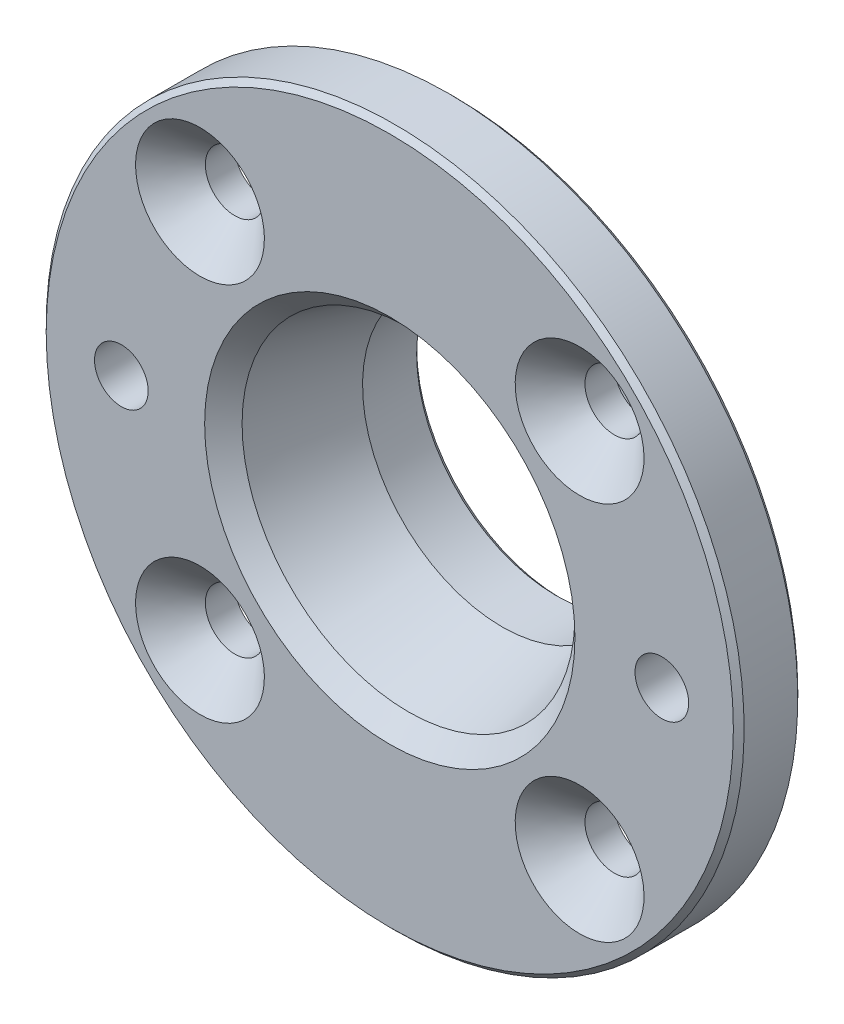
ISO-10303-21;
HEADER;
FILE_DESCRIPTION(('STEP AP214'),'2;1');
FILE_NAME('part.step','',(''),(''),'','','');
FILE_SCHEMA(('AUTOMOTIVE_DESIGN { 1 0 10303 214 1 1 1 1 }'));
ENDSEC;
DATA;
#1=APPLICATION_CONTEXT('core data for automotive mechanical design processes');
#2=APPLICATION_PROTOCOL_DEFINITION('international standard','automotive_design',2000,#1);
#3=PRODUCT_CONTEXT('',#1,'mechanical');
#4=PRODUCT('Part','Part','',(#3));
#5=PRODUCT_RELATED_PRODUCT_CATEGORY('part','',(#4));
#6=PRODUCT_DEFINITION_FORMATION('','',#4);
#7=PRODUCT_DEFINITION_CONTEXT('part definition',#1,'design');
#8=PRODUCT_DEFINITION('design','',#6,#7);
#9=PRODUCT_DEFINITION_SHAPE('','',#8);
#10=(LENGTH_UNIT() NAMED_UNIT(*) SI_UNIT(.MILLI.,.METRE.));
#11=(NAMED_UNIT(*) PLANE_ANGLE_UNIT() SI_UNIT($,.RADIAN.));
#12=(NAMED_UNIT(*) SI_UNIT($,.STERADIAN.) SOLID_ANGLE_UNIT());
#13=UNCERTAINTY_MEASURE_WITH_UNIT(LENGTH_MEASURE(1.E-05),#10,'distance_accuracy_value','');
#14=(GEOMETRIC_REPRESENTATION_CONTEXT(3) GLOBAL_UNCERTAINTY_ASSIGNED_CONTEXT((#13)) GLOBAL_UNIT_ASSIGNED_CONTEXT((#10,
#11,#12)) REPRESENTATION_CONTEXT('',''));
#15=CARTESIAN_POINT('',(0.,0.,0.));
#16=DIRECTION('',(0.,0.,1.));
#17=DIRECTION('',(1.,0.,0.));
#18=AXIS2_PLACEMENT_3D('',#15,#16,#17);
#19=CARTESIAN_POINT('',(0.,0.,-10.4622433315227));
#20=DIRECTION('',(0.,0.,1.));
#21=DIRECTION('',(0.,-1.,0.));
#22=AXIS2_PLACEMENT_3D('',#19,#20,#21);
#23=CONICAL_SURFACE('',#22,13.,0.279252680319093);
#24=CARTESIAN_POINT('',(0.,0.,-10.4622433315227));
#25=DIRECTION('',(0.,0.,1.));
#26=DIRECTION('',(0.,-1.,0.));
#27=AXIS2_PLACEMENT_3D('',#24,#25,#26);
#28=CIRCLE('',#27,13.);
#29=CARTESIAN_POINT('',(0.,-13.,-10.4622433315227));
#30=VERTEX_POINT('',#29);
#31=EDGE_CURVE('E58',#30,#30,#28,.T.);
#32=ORIENTED_EDGE('',*,*,#31,.F.);
#33=EDGE_LOOP('',(#32));
#34=FACE_BOUND('',#33,.T.);
#35=CARTESIAN_POINT('',(0.,0.,-1.74370722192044));
#36=DIRECTION('',(0.,0.,-1.));
#37=DIRECTION('',(-1.,0.,0.));
#38=AXIS2_PLACEMENT_3D('',#35,#36,#37);
#39=CIRCLE('',#38,15.5);
#40=CARTESIAN_POINT('',(-15.5,0.,-1.74370722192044));
#41=VERTEX_POINT('',#40);
#42=EDGE_CURVE('E103',#41,#41,#39,.T.);
#43=ORIENTED_EDGE('',*,*,#42,.F.);
#44=EDGE_LOOP('',(#43));
#45=FACE_BOUND('',#44,.T.);
#46=ADVANCED_FACE('F14',(#34,#45),#23,.F.);
#47=CARTESIAN_POINT('',(0.,0.,0.));
#48=DIRECTION('',(0.,0.,1.));
#49=DIRECTION('',(0.,-1.,0.));
#50=AXIS2_PLACEMENT_3D('',#47,#48,#49);
#51=CYLINDRICAL_SURFACE('',#50,13.);
#52=CARTESIAN_POINT('',(0.,0.,-15.5));
#53=DIRECTION('',(0.,0.,-1.));
#54=DIRECTION('',(0.,1.,0.));
#55=AXIS2_PLACEMENT_3D('',#52,#53,#54);
#56=CIRCLE('',#55,13.);
#57=CARTESIAN_POINT('',(0.,12.9999999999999,-15.5));
#58=VERTEX_POINT('',#57);
#59=EDGE_CURVE('E34',#58,#58,#56,.T.);
#60=ORIENTED_EDGE('',*,*,#59,.T.);
#61=EDGE_LOOP('',(#60));
#62=FACE_BOUND('',#61,.T.);
#63=ORIENTED_EDGE('',*,*,#31,.T.);
#64=EDGE_LOOP('',(#63));
#65=FACE_BOUND('',#64,.T.);
#66=ADVANCED_FACE('F159',(#62,#65),#51,.F.);
#67=CARTESIAN_POINT('',(13.,0.,-16.));
#68=DIRECTION('',(0.,0.,-1.));
#69=DIRECTION('',(0.,1.,0.));
#70=AXIS2_PLACEMENT_3D('',#67,#68,#69);
#71=PLANE('',#70);
#72=CARTESIAN_POINT('',(0.,0.,-16.));
#73=DIRECTION('',(0.,0.,-1.));
#74=DIRECTION('',(0.,1.,0.));
#75=AXIS2_PLACEMENT_3D('',#72,#73,#74);
#76=CIRCLE('',#75,13.5);
#77=CARTESIAN_POINT('',(0.,13.4999999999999,-16.));
#78=VERTEX_POINT('',#77);
#79=EDGE_CURVE('E37',#78,#78,#76,.F.);
#80=ORIENTED_EDGE('',*,*,#79,.T.);
#81=EDGE_LOOP('',(#80));
#82=FACE_BOUND('',#81,.T.);
#83=CARTESIAN_POINT('',(0.,0.,-16.));
#84=DIRECTION('',(0.,0.,-1.));
#85=DIRECTION('',(0.,1.,0.));
#86=AXIS2_PLACEMENT_3D('',#83,#84,#85);
#87=CIRCLE('',#86,17.4);
#88=CARTESIAN_POINT('',(0.,17.3999999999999,-16.0000000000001));
#89=VERTEX_POINT('',#88);
#90=EDGE_CURVE('E40',#89,#89,#87,.T.);
#91=ORIENTED_EDGE('',*,*,#90,.T.);
#92=EDGE_LOOP('',(#91));
#93=FACE_BOUND('',#92,.T.);
#94=ADVANCED_FACE('F165',(#82,#93),#71,.T.);
#95=CARTESIAN_POINT('',(0.,0.,0.));
#96=DIRECTION('',(0.,0.,1.));
#97=DIRECTION('',(0.,-1.,0.));
#98=AXIS2_PLACEMENT_3D('',#95,#96,#97);
#99=CYLINDRICAL_SURFACE('',#98,18.);
#100=CARTESIAN_POINT('',(0.,0.,-8.));
#101=DIRECTION('',(0.,0.,1.));
#102=DIRECTION('',(0.,-1.,0.));
#103=AXIS2_PLACEMENT_3D('',#100,#101,#102);
#104=CIRCLE('',#103,18.);
#105=CARTESIAN_POINT('',(0.,-18.,-7.99999999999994));
#106=VERTEX_POINT('',#105);
#107=EDGE_CURVE('E76',#106,#106,#104,.T.);
#108=ORIENTED_EDGE('',*,*,#107,.F.);
#109=EDGE_LOOP('',(#108));
#110=FACE_BOUND('',#109,.T.);
#111=CARTESIAN_POINT('',(0.,0.,-12.9));
#112=DIRECTION('',(0.,0.,1.));
#113=DIRECTION('',(0.,-1.,0.));
#114=AXIS2_PLACEMENT_3D('',#111,#112,#113);
#115=CIRCLE('',#114,18.);
#116=CARTESIAN_POINT('',(0.,-18.,-12.8999999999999));
#117=VERTEX_POINT('',#116);
#118=EDGE_CURVE('E61',#117,#117,#115,.T.);
#119=ORIENTED_EDGE('',*,*,#118,.T.);
#120=EDGE_LOOP('',(#119));
#121=FACE_BOUND('',#120,.T.);
#122=ADVANCED_FACE('F173',(#110,#121),#99,.T.);
#123=CARTESIAN_POINT('',(18.,0.,-6.));
#124=DIRECTION('',(0.,0.,-1.));
#125=DIRECTION('',(0.,1.,0.));
#126=AXIS2_PLACEMENT_3D('',#123,#124,#125);
#127=PLANE('',#126);
#128=CARTESIAN_POINT('',(-25.,0.,-6.));
#129=DIRECTION('',(0.,0.,-1.));
#130=DIRECTION('',(0.,1.,0.));
#131=AXIS2_PLACEMENT_3D('',#128,#129,#130);
#132=CIRCLE('',#131,2.5);
#133=CARTESIAN_POINT('',(-25.,2.5,-6.00000000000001));
#134=VERTEX_POINT('',#133);
#135=EDGE_CURVE('E109',#134,#134,#132,.T.);
#136=ORIENTED_EDGE('',*,*,#135,.F.);
#137=EDGE_LOOP('',(#136));
#138=FACE_BOUND('',#137,.T.);
#139=CARTESIAN_POINT('',(25.3379853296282,0.,-6.));
#140=DIRECTION('',(0.,0.,-1.));
#141=DIRECTION('',(0.,1.,0.));
#142=AXIS2_PLACEMENT_3D('',#139,#140,#141);
#143=CIRCLE('',#142,2.5);
#144=CARTESIAN_POINT('',(25.3379853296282,2.5,-6.00000000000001));
#145=VERTEX_POINT('',#144);
#146=EDGE_CURVE('E112',#145,#145,#143,.T.);
#147=ORIENTED_EDGE('',*,*,#146,.F.);
#148=EDGE_LOOP('',(#147));
#149=FACE_BOUND('',#148,.T.);
#150=CARTESIAN_POINT('',(-17.6776695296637,17.6776695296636,-6.));
#151=DIRECTION('',(0.,0.,-1.));
#152=DIRECTION('',(0.,1.,0.));
#153=AXIS2_PLACEMENT_3D('',#150,#151,#152);
#154=CIRCLE('',#153,2.75);
#155=CARTESIAN_POINT('',(-17.6776695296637,20.4276695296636,-6.00000000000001));
#156=VERTEX_POINT('',#155);
#157=EDGE_CURVE('E9',#156,#156,#154,.T.);
#158=ORIENTED_EDGE('',*,*,#157,.F.);
#159=EDGE_LOOP('',(#158));
#160=FACE_BOUND('',#159,.T.);
#161=CARTESIAN_POINT('',(17.6776695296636,17.6776695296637,-6.));
#162=DIRECTION('',(0.,0.,-1.));
#163=DIRECTION('',(0.,1.,0.));
#164=AXIS2_PLACEMENT_3D('',#161,#162,#163);
#165=CIRCLE('',#164,2.75);
#166=CARTESIAN_POINT('',(17.6776695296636,20.4276695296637,-6.00000000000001));
#167=VERTEX_POINT('',#166);
#168=EDGE_CURVE('E22',#167,#167,#165,.T.);
#169=ORIENTED_EDGE('',*,*,#168,.F.);
#170=EDGE_LOOP('',(#169));
#171=FACE_BOUND('',#170,.T.);
#172=CARTESIAN_POINT('',(17.6776695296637,-17.6776695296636,-6.));
#173=DIRECTION('',(0.,0.,-1.));
#174=DIRECTION('',(0.,1.,0.));
#175=AXIS2_PLACEMENT_3D('',#172,#173,#174);
#176=CIRCLE('',#175,2.75);
#177=CARTESIAN_POINT('',(17.6776695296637,-14.9276695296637,-6.00000000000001));
#178=VERTEX_POINT('',#177);
#179=EDGE_CURVE('E26',#178,#178,#176,.T.);
#180=ORIENTED_EDGE('',*,*,#179,.F.);
#181=EDGE_LOOP('',(#180));
#182=FACE_BOUND('',#181,.T.);
#183=CARTESIAN_POINT('',(-17.6776695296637,-17.6776695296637,-6.));
#184=DIRECTION('',(0.,0.,-1.));
#185=DIRECTION('',(0.,1.,0.));
#186=AXIS2_PLACEMENT_3D('',#183,#184,#185);
#187=CIRCLE('',#186,2.75);
#188=CARTESIAN_POINT('',(-17.6776695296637,-14.9276695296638,-6.00000000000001));
#189=VERTEX_POINT('',#188);
#190=EDGE_CURVE('E31',#189,#189,#187,.T.);
#191=ORIENTED_EDGE('',*,*,#190,.F.);
#192=EDGE_LOOP('',(#191));
#193=FACE_BOUND('',#192,.T.);
#194=CARTESIAN_POINT('',(0.,0.,-6.));
#195=DIRECTION('',(0.,0.,1.));
#196=DIRECTION('',(0.,-1.,0.));
#197=AXIS2_PLACEMENT_3D('',#194,#195,#196);
#198=CIRCLE('',#197,19.);
#199=CARTESIAN_POINT('',(0.,-19.,-5.99999999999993));
#200=VERTEX_POINT('',#199);
#201=EDGE_CURVE('E67',#200,#200,#198,.T.);
#202=ORIENTED_EDGE('',*,*,#201,.T.);
#203=EDGE_LOOP('',(#202));
#204=FACE_BOUND('',#203,.T.);
#205=CARTESIAN_POINT('',(0.,0.,-6.));
#206=DIRECTION('',(0.,0.,-1.));
#207=DIRECTION('',(0.,1.,0.));
#208=AXIS2_PLACEMENT_3D('',#205,#206,#207);
#209=CIRCLE('',#208,32.);
#210=CARTESIAN_POINT('',(0.,32.,-6.00000000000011));
#211=VERTEX_POINT('',#210);
#212=EDGE_CURVE('E46',#211,#211,#209,.T.);
#213=ORIENTED_EDGE('',*,*,#212,.T.);
#214=EDGE_LOOP('',(#213));
#215=FACE_BOUND('',#214,.T.);
#216=ADVANCED_FACE('F177',(#138,#149,#160,#171,#182,#193,#204,#215),#127,.T.);
#217=CARTESIAN_POINT('',(0.,0.,0.));
#218=DIRECTION('',(0.,0.,1.));
#219=DIRECTION('',(0.,-1.,0.));
#220=AXIS2_PLACEMENT_3D('',#217,#218,#219);
#221=CYLINDRICAL_SURFACE('',#220,32.5);
#222=CARTESIAN_POINT('',(0.,0.,-0.499999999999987));
#223=DIRECTION('',(0.,0.,1.));
#224=DIRECTION('',(0.,-1.,0.));
#225=AXIS2_PLACEMENT_3D('',#222,#223,#224);
#226=CIRCLE('',#225,32.5);
#227=CARTESIAN_POINT('',(0.,-32.5,-0.499999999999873));
#228=VERTEX_POINT('',#227);
#229=EDGE_CURVE('E49',#228,#228,#226,.F.);
#230=ORIENTED_EDGE('',*,*,#229,.T.);
#231=EDGE_LOOP('',(#230));
#232=FACE_BOUND('',#231,.T.);
#233=CARTESIAN_POINT('',(0.,0.,-5.5));
#234=DIRECTION('',(0.,0.,-1.));
#235=DIRECTION('',(0.,1.,0.));
#236=AXIS2_PLACEMENT_3D('',#233,#234,#235);
#237=CIRCLE('',#236,32.5);
#238=CARTESIAN_POINT('',(0.,32.5,-5.50000000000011));
#239=VERTEX_POINT('',#238);
#240=EDGE_CURVE('E52',#239,#239,#237,.F.);
#241=ORIENTED_EDGE('',*,*,#240,.T.);
#242=EDGE_LOOP('',(#241));
#243=FACE_BOUND('',#242,.T.);
#244=ADVANCED_FACE('F128',(#232,#243),#221,.T.);
#245=CARTESIAN_POINT('',(16.,0.,0.));
#246=DIRECTION('',(0.,0.,1.));
#247=DIRECTION('',(0.,-1.,0.));
#248=AXIS2_PLACEMENT_3D('',#245,#246,#247);
#249=PLANE('',#248);
#250=CARTESIAN_POINT('',(-25.,0.,0.));
#251=DIRECTION('',(0.,0.,1.));
#252=DIRECTION('',(1.,0.,0.));
#253=AXIS2_PLACEMENT_3D('',#250,#251,#252);
#254=CIRCLE('',#253,2.5);
#255=CARTESIAN_POINT('',(-22.5,0.,0.));
#256=VERTEX_POINT('',#255);
#257=EDGE_CURVE('E115',#256,#256,#254,.T.);
#258=ORIENTED_EDGE('',*,*,#257,.F.);
#259=EDGE_LOOP('',(#258));
#260=FACE_BOUND('',#259,.T.);
#261=CARTESIAN_POINT('',(25.3379853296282,0.,0.));
#262=DIRECTION('',(0.,0.,1.));
#263=DIRECTION('',(1.,0.,0.));
#264=AXIS2_PLACEMENT_3D('',#261,#262,#263);
#265=CIRCLE('',#264,2.5);
#266=CARTESIAN_POINT('',(27.8379853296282,0.,0.));
#267=VERTEX_POINT('',#266);
#268=EDGE_CURVE('E116',#267,#267,#265,.T.);
#269=ORIENTED_EDGE('',*,*,#268,.F.);
#270=EDGE_LOOP('',(#269));
#271=FACE_BOUND('',#270,.T.);
#272=CARTESIAN_POINT('',(0.,0.,0.));
#273=DIRECTION('',(0.,0.,-1.));
#274=DIRECTION('',(-1.,0.,0.));
#275=AXIS2_PLACEMENT_3D('',#272,#273,#274);
#276=CIRCLE('',#275,17.2437072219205);
#277=CARTESIAN_POINT('',(-17.2437072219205,0.,0.));
#278=VERTEX_POINT('',#277);
#279=EDGE_CURVE('E106',#278,#278,#276,.T.);
#280=ORIENTED_EDGE('',*,*,#279,.T.);
#281=EDGE_LOOP('',(#280));
#282=FACE_BOUND('',#281,.T.);
#283=CARTESIAN_POINT('',(17.6776695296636,17.6776695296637,0.));
#284=DIRECTION('',(0.,0.,1.));
#285=DIRECTION('',(0.,-1.,0.));
#286=AXIS2_PLACEMENT_3D('',#283,#284,#285);
#287=CIRCLE('',#286,6.);
#288=CARTESIAN_POINT('',(17.6776695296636,11.6776695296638,0.));
#289=VERTEX_POINT('',#288);
#290=EDGE_CURVE('E100',#289,#289,#287,.T.);
#291=ORIENTED_EDGE('',*,*,#290,.F.);
#292=EDGE_LOOP('',(#291));
#293=FACE_BOUND('',#292,.T.);
#294=CARTESIAN_POINT('',(17.6776695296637,-17.6776695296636,0.));
#295=DIRECTION('',(0.,0.,1.));
#296=DIRECTION('',(0.,-1.,0.));
#297=AXIS2_PLACEMENT_3D('',#294,#295,#296);
#298=CIRCLE('',#297,6.);
#299=CARTESIAN_POINT('',(17.6776695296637,-23.6776695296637,0.));
#300=VERTEX_POINT('',#299);
#301=EDGE_CURVE('E94',#300,#300,#298,.T.);
#302=ORIENTED_EDGE('',*,*,#301,.F.);
#303=EDGE_LOOP('',(#302));
#304=FACE_BOUND('',#303,.T.);
#305=CARTESIAN_POINT('',(-17.6776695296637,-17.6776695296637,0.));
#306=DIRECTION('',(0.,0.,1.));
#307=DIRECTION('',(0.,-1.,0.));
#308=AXIS2_PLACEMENT_3D('',#305,#306,#307);
#309=CIRCLE('',#308,6.);
#310=CARTESIAN_POINT('',(-17.6776695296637,-23.6776695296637,0.));
#311=VERTEX_POINT('',#310);
#312=EDGE_CURVE('E88',#311,#311,#309,.T.);
#313=ORIENTED_EDGE('',*,*,#312,.F.);
#314=EDGE_LOOP('',(#313));
#315=FACE_BOUND('',#314,.T.);
#316=CARTESIAN_POINT('',(-17.6776695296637,17.6776695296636,0.));
#317=DIRECTION('',(0.,0.,1.));
#318=DIRECTION('',(0.,-1.,0.));
#319=AXIS2_PLACEMENT_3D('',#316,#317,#318);
#320=CIRCLE('',#319,6.);
#321=CARTESIAN_POINT('',(-17.6776695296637,11.6776695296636,0.));
#322=VERTEX_POINT('',#321);
#323=EDGE_CURVE('E82',#322,#322,#320,.T.);
#324=ORIENTED_EDGE('',*,*,#323,.F.);
#325=EDGE_LOOP('',(#324));
#326=FACE_BOUND('',#325,.T.);
#327=CARTESIAN_POINT('',(0.,0.,0.));
#328=DIRECTION('',(0.,0.,1.));
#329=DIRECTION('',(0.,-1.,0.));
#330=AXIS2_PLACEMENT_3D('',#327,#328,#329);
#331=CIRCLE('',#330,32.);
#332=CARTESIAN_POINT('',(0.,-32.,1.1172740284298E-13));
#333=VERTEX_POINT('',#332);
#334=EDGE_CURVE('E55',#333,#333,#331,.T.);
#335=ORIENTED_EDGE('',*,*,#334,.T.);
#336=EDGE_LOOP('',(#335));
#337=FACE_BOUND('',#336,.T.);
#338=ADVANCED_FACE('F124',(#260,#271,#282,#293,#304,#315,#326,#337),#249,.T.);
#339=CARTESIAN_POINT('',(0.,0.,0.));
#340=DIRECTION('',(0.,0.,-1.));
#341=DIRECTION('',(0.,1.,0.));
#342=AXIS2_PLACEMENT_3D('',#339,#340,#341);
#343=CONICAL_SURFACE('',#342,32.,0.785398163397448);
#344=ORIENTED_EDGE('',*,*,#229,.F.);
#345=EDGE_LOOP('',(#344));
#346=FACE_BOUND('',#345,.T.);
#347=ORIENTED_EDGE('',*,*,#334,.F.);
#348=EDGE_LOOP('',(#347));
#349=FACE_BOUND('',#348,.T.);
#350=ADVANCED_FACE('F127',(#346,#349),#343,.T.);
#351=CARTESIAN_POINT('',(0.,0.,-5.5));
#352=DIRECTION('',(0.,0.,1.));
#353=DIRECTION('',(0.,-1.,0.));
#354=AXIS2_PLACEMENT_3D('',#351,#352,#353);
#355=CONICAL_SURFACE('',#354,32.5,0.785398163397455);
#356=ORIENTED_EDGE('',*,*,#212,.F.);
#357=EDGE_LOOP('',(#356));
#358=FACE_BOUND('',#357,.T.);
#359=ORIENTED_EDGE('',*,*,#240,.F.);
#360=EDGE_LOOP('',(#359));
#361=FACE_BOUND('',#360,.T.);
#362=ADVANCED_FACE('F145',(#358,#361),#355,.T.);
#363=CARTESIAN_POINT('',(0.,0.,-13.));
#364=DIRECTION('',(0.,0.,1.));
#365=DIRECTION('',(0.,-1.,0.));
#366=AXIS2_PLACEMENT_3D('',#363,#364,#365);
#367=CONICAL_SURFACE('',#366,17.9,0.785398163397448);
#368=ORIENTED_EDGE('',*,*,#118,.F.);
#369=EDGE_LOOP('',(#368));
#370=FACE_BOUND('',#369,.T.);
#371=CARTESIAN_POINT('',(0.,0.,-13.));
#372=DIRECTION('',(0.,0.,1.));
#373=DIRECTION('',(0.,-1.,0.));
#374=AXIS2_PLACEMENT_3D('',#371,#372,#373);
#375=CIRCLE('',#374,17.9);
#376=CARTESIAN_POINT('',(0.,-17.9,-12.9999999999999));
#377=VERTEX_POINT('',#376);
#378=EDGE_CURVE('E64',#377,#377,#375,.T.);
#379=ORIENTED_EDGE('',*,*,#378,.T.);
#380=EDGE_LOOP('',(#379));
#381=FACE_BOUND('',#380,.T.);
#382=ADVANCED_FACE('F153',(#370,#381),#367,.T.);
#383=CARTESIAN_POINT('',(0.,0.,0.));
#384=DIRECTION('',(0.,0.,1.));
#385=DIRECTION('',(0.,-1.,0.));
#386=AXIS2_PLACEMENT_3D('',#383,#384,#385);
#387=CYLINDRICAL_SURFACE('',#386,17.9);
#388=CARTESIAN_POINT('',(0.,0.,-15.5));
#389=DIRECTION('',(0.,0.,-1.));
#390=DIRECTION('',(0.,1.,0.));
#391=AXIS2_PLACEMENT_3D('',#388,#389,#390);
#392=CIRCLE('',#391,17.9);
#393=CARTESIAN_POINT('',(0.,17.8999999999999,-15.5000000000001));
#394=VERTEX_POINT('',#393);
#395=EDGE_CURVE('E43',#394,#394,#392,.F.);
#396=ORIENTED_EDGE('',*,*,#395,.T.);
#397=EDGE_LOOP('',(#396));
#398=FACE_BOUND('',#397,.T.);
#399=ORIENTED_EDGE('',*,*,#378,.F.);
#400=EDGE_LOOP('',(#399));
#401=FACE_BOUND('',#400,.T.);
#402=ADVANCED_FACE('F187',(#398,#401),#387,.T.);
#403=CARTESIAN_POINT('',(0.,0.,-15.5));
#404=DIRECTION('',(0.,0.,1.));
#405=DIRECTION('',(0.,-1.,0.));
#406=AXIS2_PLACEMENT_3D('',#403,#404,#405);
#407=CONICAL_SURFACE('',#406,17.9,0.785398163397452);
#408=ORIENTED_EDGE('',*,*,#90,.F.);
#409=EDGE_LOOP('',(#408));
#410=FACE_BOUND('',#409,.T.);
#411=ORIENTED_EDGE('',*,*,#395,.F.);
#412=EDGE_LOOP('',(#411));
#413=FACE_BOUND('',#412,.T.);
#414=ADVANCED_FACE('F191',(#410,#413),#407,.T.);
#415=CARTESIAN_POINT('',(0.,0.,-5.5));
#416=DIRECTION('',(0.,0.,-1.));
#417=DIRECTION('',(0.,1.,0.));
#418=AXIS2_PLACEMENT_3D('',#415,#416,#417);
#419=CONICAL_SURFACE('',#418,18.5,0.785398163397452);
#420=ORIENTED_EDGE('',*,*,#201,.F.);
#421=EDGE_LOOP('',(#420));
#422=FACE_BOUND('',#421,.T.);
#423=CARTESIAN_POINT('',(0.,0.,-5.5));
#424=DIRECTION('',(0.,0.,1.));
#425=DIRECTION('',(0.,-1.,0.));
#426=AXIS2_PLACEMENT_3D('',#423,#424,#425);
#427=CIRCLE('',#426,18.5);
#428=CARTESIAN_POINT('',(0.,-18.5,-5.49999999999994));
#429=VERTEX_POINT('',#428);
#430=EDGE_CURVE('E70',#429,#429,#427,.T.);
#431=ORIENTED_EDGE('',*,*,#430,.T.);
#432=EDGE_LOOP('',(#431));
#433=FACE_BOUND('',#432,.T.);
#434=ADVANCED_FACE('F193',(#422,#433),#419,.F.);
#435=CARTESIAN_POINT('',(17.5,0.,-5.5));
#436=DIRECTION('',(0.,0.,1.));
#437=DIRECTION('',(0.,-1.,0.));
#438=AXIS2_PLACEMENT_3D('',#435,#436,#437);
#439=PLANE('',#438);
#440=CARTESIAN_POINT('',(0.,0.,-5.5));
#441=DIRECTION('',(0.,0.,1.));
#442=DIRECTION('',(0.,-1.,0.));
#443=AXIS2_PLACEMENT_3D('',#440,#441,#442);
#444=CIRCLE('',#443,17.5);
#445=CARTESIAN_POINT('',(0.,-17.5,-5.49999999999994));
#446=VERTEX_POINT('',#445);
#447=EDGE_CURVE('E18',#446,#446,#444,.T.);
#448=ORIENTED_EDGE('',*,*,#447,.T.);
#449=EDGE_LOOP('',(#448));
#450=FACE_BOUND('',#449,.T.);
#451=ORIENTED_EDGE('',*,*,#430,.F.);
#452=EDGE_LOOP('',(#451));
#453=FACE_BOUND('',#452,.T.);
#454=ADVANCED_FACE('F196',(#450,#453),#439,.F.);
#455=CARTESIAN_POINT('',(0.,0.,0.));
#456=DIRECTION('',(0.,0.,1.));
#457=DIRECTION('',(0.,-1.,0.));
#458=AXIS2_PLACEMENT_3D('',#455,#456,#457);
#459=CYLINDRICAL_SURFACE('',#458,17.5);
#460=ORIENTED_EDGE('',*,*,#447,.F.);
#461=EDGE_LOOP('',(#460));
#462=FACE_BOUND('',#461,.T.);
#463=CARTESIAN_POINT('',(0.,0.,-7.5));
#464=DIRECTION('',(0.,0.,1.));
#465=DIRECTION('',(0.,-1.,0.));
#466=AXIS2_PLACEMENT_3D('',#463,#464,#465);
#467=CIRCLE('',#466,17.5);
#468=CARTESIAN_POINT('',(0.,-17.5,-7.49999999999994));
#469=VERTEX_POINT('',#468);
#470=EDGE_CURVE('E73',#469,#469,#467,.T.);
#471=ORIENTED_EDGE('',*,*,#470,.T.);
#472=EDGE_LOOP('',(#471));
#473=FACE_BOUND('',#472,.T.);
#474=ADVANCED_FACE('F200',(#462,#473),#459,.T.);
#475=CARTESIAN_POINT('',(0.,0.,-8.));
#476=DIRECTION('',(0.,0.,-1.));
#477=DIRECTION('',(0.,1.,0.));
#478=AXIS2_PLACEMENT_3D('',#475,#476,#477);
#479=CONICAL_SURFACE('',#478,18.,0.785398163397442);
#480=ORIENTED_EDGE('',*,*,#470,.F.);
#481=EDGE_LOOP('',(#480));
#482=FACE_BOUND('',#481,.T.);
#483=ORIENTED_EDGE('',*,*,#107,.T.);
#484=EDGE_LOOP('',(#483));
#485=FACE_BOUND('',#484,.T.);
#486=ADVANCED_FACE('F204',(#482,#485),#479,.T.);
#487=CARTESIAN_POINT('',(-17.6776695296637,17.6776695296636,0.));
#488=DIRECTION('',(0.,0.,1.));
#489=DIRECTION('',(0.,-1.,0.));
#490=AXIS2_PLACEMENT_3D('',#487,#488,#489);
#491=CYLINDRICAL_SURFACE('',#490,2.75);
#492=CARTESIAN_POINT('',(-17.6776695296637,17.6776695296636,-3.25000000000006));
#493=DIRECTION('',(0.,0.,1.));
#494=DIRECTION('',(0.,-1.,0.));
#495=AXIS2_PLACEMENT_3D('',#492,#493,#494);
#496=CIRCLE('',#495,2.75);
#497=CARTESIAN_POINT('',(-17.6776695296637,14.9276695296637,-3.25000000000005));
#498=VERTEX_POINT('',#497);
#499=EDGE_CURVE('E79',#498,#498,#496,.T.);
#500=ORIENTED_EDGE('',*,*,#499,.T.);
#501=EDGE_LOOP('',(#500));
#502=FACE_BOUND('',#501,.T.);
#503=ORIENTED_EDGE('',*,*,#157,.T.);
#504=EDGE_LOOP('',(#503));
#505=FACE_BOUND('',#504,.T.);
#506=ADVANCED_FACE('F16',(#502,#505),#491,.F.);
#507=CARTESIAN_POINT('',(-17.6776695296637,17.6776695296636,0.));
#508=DIRECTION('',(0.,0.,1.));
#509=DIRECTION('',(0.,-1.,0.));
#510=AXIS2_PLACEMENT_3D('',#507,#508,#509);
#511=CONICAL_SURFACE('',#510,6.,0.785398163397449);
#512=ORIENTED_EDGE('',*,*,#499,.F.);
#513=EDGE_LOOP('',(#512));
#514=FACE_BOUND('',#513,.T.);
#515=ORIENTED_EDGE('',*,*,#323,.T.);
#516=EDGE_LOOP('',(#515));
#517=FACE_BOUND('',#516,.T.);
#518=ADVANCED_FACE('F209',(#514,#517),#511,.F.);
#519=CARTESIAN_POINT('',(-17.6776695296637,-17.6776695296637,0.));
#520=DIRECTION('',(0.,0.,1.));
#521=DIRECTION('',(0.,-1.,0.));
#522=AXIS2_PLACEMENT_3D('',#519,#520,#521);
#523=CYLINDRICAL_SURFACE('',#522,2.75);
#524=CARTESIAN_POINT('',(-17.6776695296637,-17.6776695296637,-3.24999999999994));
#525=DIRECTION('',(0.,0.,1.));
#526=DIRECTION('',(0.,-1.,0.));
#527=AXIS2_PLACEMENT_3D('',#524,#525,#526);
#528=CIRCLE('',#527,2.75);
#529=CARTESIAN_POINT('',(-17.6776695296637,-20.4276695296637,-3.24999999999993));
#530=VERTEX_POINT('',#529);
#531=EDGE_CURVE('E85',#530,#530,#528,.T.);
#532=ORIENTED_EDGE('',*,*,#531,.T.);
#533=EDGE_LOOP('',(#532));
#534=FACE_BOUND('',#533,.T.);
#535=ORIENTED_EDGE('',*,*,#190,.T.);
#536=EDGE_LOOP('',(#535));
#537=FACE_BOUND('',#536,.T.);
#538=ADVANCED_FACE('F212',(#534,#537),#523,.F.);
#539=CARTESIAN_POINT('',(-17.6776695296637,-17.6776695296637,0.));
#540=DIRECTION('',(0.,0.,1.));
#541=DIRECTION('',(0.,-1.,0.));
#542=AXIS2_PLACEMENT_3D('',#539,#540,#541);
#543=CONICAL_SURFACE('',#542,6.,0.785398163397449);
#544=ORIENTED_EDGE('',*,*,#531,.F.);
#545=EDGE_LOOP('',(#544));
#546=FACE_BOUND('',#545,.T.);
#547=ORIENTED_EDGE('',*,*,#312,.T.);
#548=EDGE_LOOP('',(#547));
#549=FACE_BOUND('',#548,.T.);
#550=ADVANCED_FACE('F214',(#546,#549),#543,.F.);
#551=CARTESIAN_POINT('',(17.6776695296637,-17.6776695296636,0.));
#552=DIRECTION('',(0.,0.,1.));
#553=DIRECTION('',(0.,-1.,0.));
#554=AXIS2_PLACEMENT_3D('',#551,#552,#553);
#555=CYLINDRICAL_SURFACE('',#554,2.75);
#556=CARTESIAN_POINT('',(17.6776695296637,-17.6776695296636,-3.24999999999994));
#557=DIRECTION('',(0.,0.,1.));
#558=DIRECTION('',(0.,-1.,0.));
#559=AXIS2_PLACEMENT_3D('',#556,#557,#558);
#560=CIRCLE('',#559,2.75);
#561=CARTESIAN_POINT('',(17.6776695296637,-20.4276695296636,-3.24999999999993));
#562=VERTEX_POINT('',#561);
#563=EDGE_CURVE('E91',#562,#562,#560,.T.);
#564=ORIENTED_EDGE('',*,*,#563,.T.);
#565=EDGE_LOOP('',(#564));
#566=FACE_BOUND('',#565,.T.);
#567=ORIENTED_EDGE('',*,*,#179,.T.);
#568=EDGE_LOOP('',(#567));
#569=FACE_BOUND('',#568,.T.);
#570=ADVANCED_FACE('F217',(#566,#569),#555,.F.);
#571=CARTESIAN_POINT('',(17.6776695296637,-17.6776695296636,0.));
#572=DIRECTION('',(0.,0.,1.));
#573=DIRECTION('',(0.,-1.,0.));
#574=AXIS2_PLACEMENT_3D('',#571,#572,#573);
#575=CONICAL_SURFACE('',#574,6.,0.785398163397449);
#576=ORIENTED_EDGE('',*,*,#563,.F.);
#577=EDGE_LOOP('',(#576));
#578=FACE_BOUND('',#577,.T.);
#579=ORIENTED_EDGE('',*,*,#301,.T.);
#580=EDGE_LOOP('',(#579));
#581=FACE_BOUND('',#580,.T.);
#582=ADVANCED_FACE('F219',(#578,#581),#575,.F.);
#583=CARTESIAN_POINT('',(17.6776695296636,17.6776695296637,0.));
#584=DIRECTION('',(0.,0.,1.));
#585=DIRECTION('',(0.,-1.,0.));
#586=AXIS2_PLACEMENT_3D('',#583,#584,#585);
#587=CYLINDRICAL_SURFACE('',#586,2.75);
#588=CARTESIAN_POINT('',(17.6776695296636,17.6776695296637,-3.25000000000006));
#589=DIRECTION('',(0.,0.,1.));
#590=DIRECTION('',(0.,-1.,0.));
#591=AXIS2_PLACEMENT_3D('',#588,#589,#590);
#592=CIRCLE('',#591,2.75);
#593=CARTESIAN_POINT('',(17.6776695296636,14.9276695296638,-3.25000000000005));
#594=VERTEX_POINT('',#593);
#595=EDGE_CURVE('E97',#594,#594,#592,.T.);
#596=ORIENTED_EDGE('',*,*,#595,.T.);
#597=EDGE_LOOP('',(#596));
#598=FACE_BOUND('',#597,.T.);
#599=ORIENTED_EDGE('',*,*,#168,.T.);
#600=EDGE_LOOP('',(#599));
#601=FACE_BOUND('',#600,.T.);
#602=ADVANCED_FACE('F222',(#598,#601),#587,.F.);
#603=CARTESIAN_POINT('',(17.6776695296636,17.6776695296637,0.));
#604=DIRECTION('',(0.,0.,1.));
#605=DIRECTION('',(0.,-1.,0.));
#606=AXIS2_PLACEMENT_3D('',#603,#604,#605);
#607=CONICAL_SURFACE('',#606,6.,0.785398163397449);
#608=ORIENTED_EDGE('',*,*,#595,.F.);
#609=EDGE_LOOP('',(#608));
#610=FACE_BOUND('',#609,.T.);
#611=ORIENTED_EDGE('',*,*,#290,.T.);
#612=EDGE_LOOP('',(#611));
#613=FACE_BOUND('',#612,.T.);
#614=ADVANCED_FACE('F224',(#610,#613),#607,.F.);
#615=CARTESIAN_POINT('',(0.,0.,-16.));
#616=DIRECTION('',(0.,0.,-1.));
#617=DIRECTION('',(0.,1.,0.));
#618=AXIS2_PLACEMENT_3D('',#615,#616,#617);
#619=CONICAL_SURFACE('',#618,13.5,0.785398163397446);
#620=ORIENTED_EDGE('',*,*,#59,.F.);
#621=EDGE_LOOP('',(#620));
#622=FACE_BOUND('',#621,.T.);
#623=ORIENTED_EDGE('',*,*,#79,.F.);
#624=EDGE_LOOP('',(#623));
#625=FACE_BOUND('',#624,.T.);
#626=ADVANCED_FACE('F227',(#622,#625),#619,.F.);
#627=CARTESIAN_POINT('',(0.,0.,0.));
#628=DIRECTION('',(0.,0.,1.));
#629=DIRECTION('',(1.,0.,0.));
#630=AXIS2_PLACEMENT_3D('',#627,#628,#629);
#631=CONICAL_SURFACE('',#630,17.2437072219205,0.78539816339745);
#632=ORIENTED_EDGE('',*,*,#42,.T.);
#633=EDGE_LOOP('',(#632));
#634=FACE_BOUND('',#633,.T.);
#635=ORIENTED_EDGE('',*,*,#279,.F.);
#636=EDGE_LOOP('',(#635));
#637=FACE_BOUND('',#636,.T.);
#638=ADVANCED_FACE('F229',(#634,#637),#631,.F.);
#639=CARTESIAN_POINT('',(25.3379853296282,0.,-16.));
#640=DIRECTION('',(0.,0.,1.));
#641=DIRECTION('',(1.,0.,0.));
#642=AXIS2_PLACEMENT_3D('',#639,#640,#641);
#643=CYLINDRICAL_SURFACE('',#642,2.5);
#644=ORIENTED_EDGE('',*,*,#146,.T.);
#645=EDGE_LOOP('',(#644));
#646=FACE_BOUND('',#645,.T.);
#647=ORIENTED_EDGE('',*,*,#268,.T.);
#648=EDGE_LOOP('',(#647));
#649=FACE_BOUND('',#648,.T.);
#650=ADVANCED_FACE('F232',(#646,#649),#643,.F.);
#651=CARTESIAN_POINT('',(-25.,0.,-16.));
#652=DIRECTION('',(0.,0.,1.));
#653=DIRECTION('',(1.,0.,0.));
#654=AXIS2_PLACEMENT_3D('',#651,#652,#653);
#655=CYLINDRICAL_SURFACE('',#654,2.5);
#656=ORIENTED_EDGE('',*,*,#135,.T.);
#657=EDGE_LOOP('',(#656));
#658=FACE_BOUND('',#657,.T.);
#659=ORIENTED_EDGE('',*,*,#257,.T.);
#660=EDGE_LOOP('',(#659));
#661=FACE_BOUND('',#660,.T.);
#662=ADVANCED_FACE('F122',(#658,#661),#655,.F.);
#663=CLOSED_SHELL('',(#46,#66,#94,#122,#216,#244,#338,#350,#362,#382,#402,#414,#434,#454,#474,
#486,#506,#518,#538,#550,#570,#582,#602,#614,#626,#638,#650,#662));
#664=MANIFOLD_SOLID_BREP('B1',#663);
#665=ADVANCED_BREP_SHAPE_REPRESENTATION('',(#18,#664),#14);
#666=SHAPE_DEFINITION_REPRESENTATION(#9,#665);
ENDSEC;
END-ISO-10303-21;
